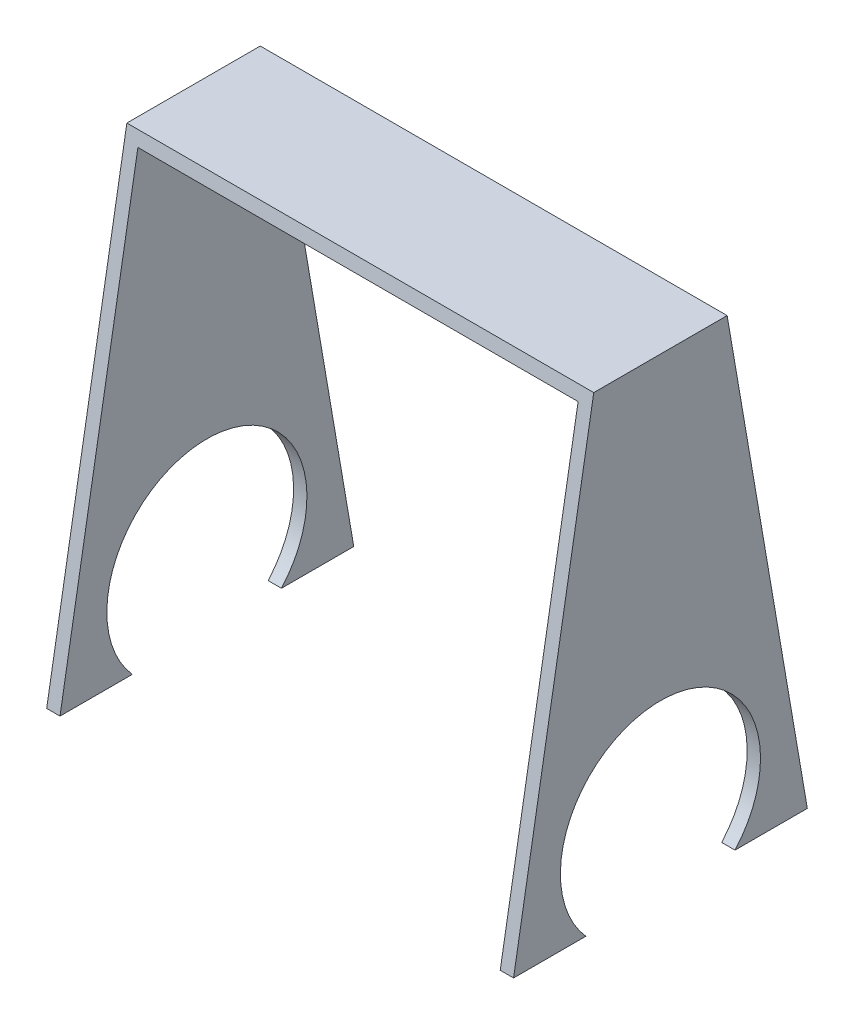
from build123d import *

# Parameters (mm, degrees)
BASE_EXTRUSION_DEPTH    = 4.5
ESQUISSE2_R             = 1.5
ENL_V_MAT_EXTRU_2_DEPTH = 51.687769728
ESQUISSE3_W             = 20
ESQUISSE3_H             = 20
ENL_V_MAT_EXTRU_3_DEPTH = 51.687769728


with BuildPart() as part:
    # Esquisse1 → Base-Extrusion (new body)
    with BuildSketch(Plane.XY):
        Polygon((-30, 50), (-30, 43), (-29.8, 43), (-29.8, 49.8), (-23.2, 49.8), (-23.2, 43), (-23, 43), (-23, 50), align=None)
    extrude(amount=BASE_EXTRUSION_DEPTH)

    # Esquisse2 → Enl_v. mat.-Extru.2 (cut, through all)
    with BuildSketch(Plane(origin=(-23, 0, 0), x_dir=(0, 0, -1), z_dir=(1, 0, 0))):
        with Locations((-2.25, 44)):
            Circle(ESQUISSE2_R)
    extrude(amount=-ENL_V_MAT_EXTRU_2_DEPTH, mode=Mode.SUBTRACT)

    # Esquisse3 → Enl_v. mat.-Extru.3 (cut, through all)
    with BuildSketch(Plane(origin=(-23, 0, 0), x_dir=(0, 0, -1), z_dir=(1, 0, 0))):
        with Locations((0, 50)):
            Rectangle(ESQUISSE3_W, ESQUISSE3_H)
        Polygon((-3.25, 50), (-1.25, 50), (0, 42.721166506), (-4.5, 42.721166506), align=None, mode=Mode.SUBTRACT)
    extrude(amount=-ENL_V_MAT_EXTRU_3_DEPTH, mode=Mode.SUBTRACT)


solid = part.part
